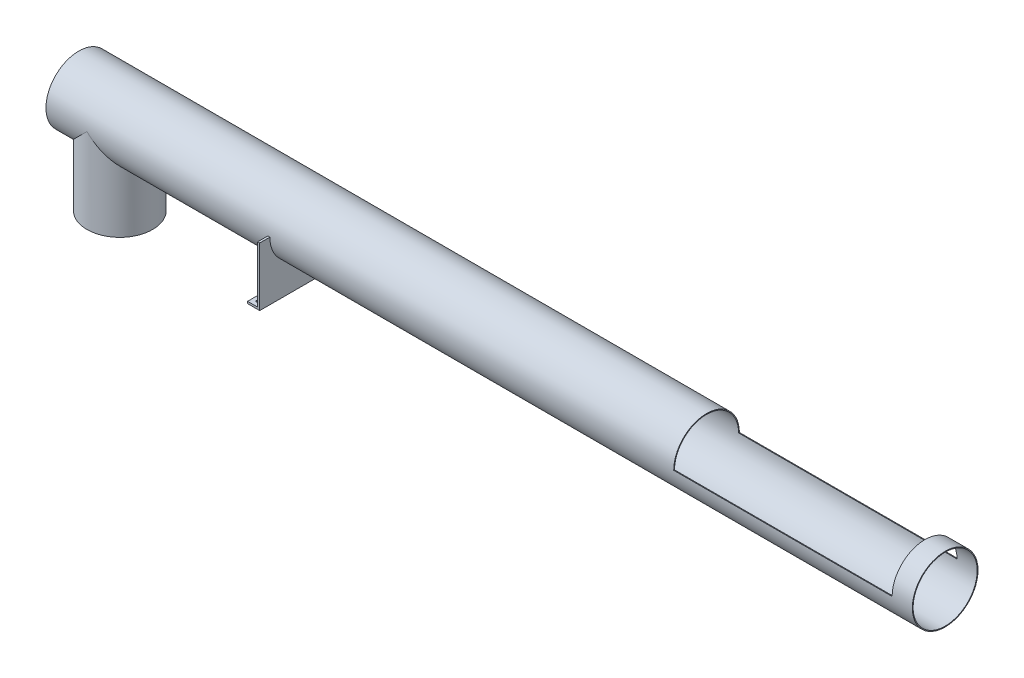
ISO-10303-21;
HEADER;
FILE_DESCRIPTION(('STEP AP214'),'2;1');
FILE_NAME('part.step','',(''),(''),'','','');
FILE_SCHEMA(('AUTOMOTIVE_DESIGN { 1 0 10303 214 1 1 1 1 }'));
ENDSEC;
DATA;
#1=APPLICATION_CONTEXT('core data for automotive mechanical design processes');
#2=APPLICATION_PROTOCOL_DEFINITION('international standard','automotive_design',2000,#1);
#3=PRODUCT_CONTEXT('',#1,'mechanical');
#4=PRODUCT('Part','Part','',(#3));
#5=PRODUCT_RELATED_PRODUCT_CATEGORY('part','',(#4));
#6=PRODUCT_DEFINITION_FORMATION('','',#4);
#7=PRODUCT_DEFINITION_CONTEXT('part definition',#1,'design');
#8=PRODUCT_DEFINITION('design','',#6,#7);
#9=PRODUCT_DEFINITION_SHAPE('','',#8);
#10=(LENGTH_UNIT() NAMED_UNIT(*) SI_UNIT(.MILLI.,.METRE.));
#11=(NAMED_UNIT(*) PLANE_ANGLE_UNIT() SI_UNIT($,.RADIAN.));
#12=(NAMED_UNIT(*) SI_UNIT($,.STERADIAN.) SOLID_ANGLE_UNIT());
#13=UNCERTAINTY_MEASURE_WITH_UNIT(LENGTH_MEASURE(1.E-05),#10,'distance_accuracy_value','');
#14=(GEOMETRIC_REPRESENTATION_CONTEXT(3) GLOBAL_UNCERTAINTY_ASSIGNED_CONTEXT((#13)) GLOBAL_UNIT_ASSIGNED_CONTEXT((#10,
#11,#12)) REPRESENTATION_CONTEXT('',''));
#15=CARTESIAN_POINT('',(0.,0.,0.));
#16=DIRECTION('',(0.,0.,1.));
#17=DIRECTION('',(1.,0.,0.));
#18=AXIS2_PLACEMENT_3D('',#15,#16,#17);
#19=CARTESIAN_POINT('',(0.,-280.,0.));
#20=DIRECTION('',(0.,1.,0.));
#21=DIRECTION('',(0.,0.,1.));
#22=AXIS2_PLACEMENT_3D('',#19,#20,#21);
#23=PLANE('',#22);
#24=DIRECTION('',(0.,0.,1.));
#25=VECTOR('',#24,1.);
#26=CARTESIAN_POINT('',(-1046.,-280.,212.5));
#27=LINE('',#26,#25);
#28=CARTESIAN_POINT('',(-1046.,-280.,-132.499999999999));
#29=VERTEX_POINT('',#28);
#30=CARTESIAN_POINT('',(-1046.,-280.,132.499999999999));
#31=VERTEX_POINT('',#30);
#32=EDGE_CURVE('E277',#29,#31,#27,.T.);
#33=ORIENTED_EDGE('',*,*,#32,.F.);
#34=DIRECTION('',(1.,0.,0.));
#35=VECTOR('',#34,1.);
#36=CARTESIAN_POINT('',(-1096.,-280.,-132.499999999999));
#37=LINE('',#36,#35);
#38=CARTESIAN_POINT('',(-1096.,-280.,-132.499999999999));
#39=VERTEX_POINT('',#38);
#40=EDGE_CURVE('E197',#39,#29,#37,.T.);
#41=ORIENTED_EDGE('',*,*,#40,.F.);
#42=DIRECTION('',(0.,0.,-1.));
#43=VECTOR('',#42,1.);
#44=CARTESIAN_POINT('',(-1096.,-280.,212.5));
#45=LINE('',#44,#43);
#46=CARTESIAN_POINT('',(-1096.,-280.,132.499999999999));
#47=VERTEX_POINT('',#46);
#48=EDGE_CURVE('E241',#47,#39,#45,.T.);
#49=ORIENTED_EDGE('',*,*,#48,.F.);
#50=DIRECTION('',(1.,0.,0.));
#51=VECTOR('',#50,1.);
#52=CARTESIAN_POINT('',(-1096.,-280.,132.499999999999));
#53=LINE('',#52,#51);
#54=EDGE_CURVE('E204',#47,#31,#53,.T.);
#55=ORIENTED_EDGE('',*,*,#54,.T.);
#56=EDGE_LOOP('',(#33,#41,#49,#55));
#57=FACE_BOUND('',#56,.T.);
#58=ADVANCED_FACE('F39',(#57),#23,.T.);
#59=CARTESIAN_POINT('',(-1071.,-280.,-187.5));
#60=DIRECTION('',(0.,-1.,0.));
#61=DIRECTION('',(0.,0.,-1.));
#62=AXIS2_PLACEMENT_3D('',#59,#60,#61);
#63=CIRCLE('',#62,6.4999999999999);
#64=CARTESIAN_POINT('',(-1071.,-280.,-194.));
#65=VERTEX_POINT('',#64);
#66=EDGE_CURVE('E433',#65,#65,#63,.T.);
#67=ORIENTED_EDGE('',*,*,#66,.T.);
#68=EDGE_LOOP('',(#67));
#69=FACE_BOUND('',#68,.T.);
#70=DIRECTION('',(1.,0.,0.));
#71=VECTOR('',#70,1.);
#72=CARTESIAN_POINT('',(-1096.,-280.,-142.499999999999));
#73=LINE('',#72,#71);
#74=CARTESIAN_POINT('',(-1096.,-280.,-142.499999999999));
#75=VERTEX_POINT('',#74);
#76=CARTESIAN_POINT('',(-1046.,-280.,-142.499999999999));
#77=VERTEX_POINT('',#76);
#78=EDGE_CURVE('E54',#75,#77,#73,.T.);
#79=ORIENTED_EDGE('',*,*,#78,.T.);
#80=CARTESIAN_POINT('',(-1046.,-280.,-212.5));
#81=VERTEX_POINT('',#80);
#82=EDGE_CURVE('E193',#81,#77,#27,.T.);
#83=ORIENTED_EDGE('',*,*,#82,.F.);
#84=DIRECTION('',(1.,0.,0.));
#85=VECTOR('',#84,1.);
#86=CARTESIAN_POINT('',(-1036.,-280.,-212.5));
#87=LINE('',#86,#85);
#88=CARTESIAN_POINT('',(-1096.,-280.,-212.5));
#89=VERTEX_POINT('',#88);
#90=EDGE_CURVE('E240',#89,#81,#87,.T.);
#91=ORIENTED_EDGE('',*,*,#90,.F.);
#92=EDGE_CURVE('E223',#75,#89,#45,.T.);
#93=ORIENTED_EDGE('',*,*,#92,.F.);
#94=EDGE_LOOP('',(#79,#83,#91,#93));
#95=FACE_BOUND('',#94,.T.);
#96=ADVANCED_FACE('F371',(#69,#95),#23,.T.);
#97=CARTESIAN_POINT('',(2144.,0.,0.));
#98=DIRECTION('',(-1.,0.,0.));
#99=DIRECTION('',(0.,0.,1.));
#100=AXIS2_PLACEMENT_3D('',#97,#98,#99);
#101=CYLINDRICAL_SURFACE('',#100,162.5);
#102=CARTESIAN_POINT('',(-1941.,0.,1.18851971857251E-13));
#103=DIRECTION('',(-0.707106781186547,-0.707106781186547,0.));
#104=DIRECTION('',(0.707106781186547,-0.707106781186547,0.));
#105=AXIS2_PLACEMENT_3D('',#102,#103,#104);
#106=ELLIPSE('',#105,229.809703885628,162.5);
#107=CARTESIAN_POINT('',(-1941.,0.,162.5));
#108=VERTEX_POINT('',#107);
#109=CARTESIAN_POINT('',(-1941.,0.,-162.5));
#110=VERTEX_POINT('',#109);
#111=EDGE_CURVE('E300',#108,#110,#106,.F.);
#112=ORIENTED_EDGE('',*,*,#111,.T.);
#113=CARTESIAN_POINT('',(-1941.,0.,1.18851971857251E-13));
#114=DIRECTION('',(0.707106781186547,-0.707106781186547,0.));
#115=DIRECTION('',(-0.707106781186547,-0.707106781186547,0.));
#116=AXIS2_PLACEMENT_3D('',#113,#114,#115);
#117=ELLIPSE('',#116,229.809703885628,162.5);
#118=EDGE_CURVE('E301',#110,#108,#117,.F.);
#119=ORIENTED_EDGE('',*,*,#118,.T.);
#120=EDGE_LOOP('',(#112,#119));
#121=FACE_BOUND('',#120,.T.);
#122=CARTESIAN_POINT('',(2144.,0.,0.));
#123=DIRECTION('',(1.,0.,0.));
#124=DIRECTION('',(0.,0.,-1.));
#125=AXIS2_PLACEMENT_3D('',#122,#123,#124);
#126=CIRCLE('',#125,162.5);
#127=CARTESIAN_POINT('',(2144.,0.,-162.5));
#128=VERTEX_POINT('',#127);
#129=EDGE_CURVE('E326',#128,#128,#126,.T.);
#130=ORIENTED_EDGE('',*,*,#129,.F.);
#131=EDGE_LOOP('',(#130));
#132=FACE_BOUND('',#131,.T.);
#133=CARTESIAN_POINT('',(-2144.,0.,0.));
#134=DIRECTION('',(1.,0.,0.));
#135=DIRECTION('',(0.,0.,-1.));
#136=AXIS2_PLACEMENT_3D('',#133,#134,#135);
#137=CIRCLE('',#136,162.5);
#138=CARTESIAN_POINT('',(-2144.,0.,-162.5));
#139=VERTEX_POINT('',#138);
#140=EDGE_CURVE('E323',#139,#139,#137,.T.);
#141=ORIENTED_EDGE('',*,*,#140,.T.);
#142=EDGE_LOOP('',(#141));
#143=FACE_BOUND('',#142,.T.);
#144=CARTESIAN_POINT('',(2044.,0.,0.));
#145=DIRECTION('',(-1.,0.,0.));
#146=DIRECTION('',(0.,0.,1.));
#147=AXIS2_PLACEMENT_3D('',#144,#145,#146);
#148=CIRCLE('',#147,162.5);
#149=CARTESIAN_POINT('',(2044.,0.,162.5));
#150=VERTEX_POINT('',#149);
#151=CARTESIAN_POINT('',(2044.,0.,-162.5));
#152=VERTEX_POINT('',#151);
#153=EDGE_CURVE('E317',#150,#152,#148,.T.);
#154=ORIENTED_EDGE('',*,*,#153,.F.);
#155=DIRECTION('',(1.,0.,0.));
#156=VECTOR('',#155,1.);
#157=CARTESIAN_POINT('',(2044.,0.,162.5));
#158=LINE('',#157,#156);
#159=CARTESIAN_POINT('',(963.,0.,162.5));
#160=VERTEX_POINT('',#159);
#161=EDGE_CURVE('E313',#160,#150,#158,.T.);
#162=ORIENTED_EDGE('',*,*,#161,.F.);
#163=CARTESIAN_POINT('',(963.,0.,0.));
#164=DIRECTION('',(1.,0.,0.));
#165=DIRECTION('',(0.,0.,-1.));
#166=AXIS2_PLACEMENT_3D('',#163,#164,#165);
#167=CIRCLE('',#166,162.5);
#168=CARTESIAN_POINT('',(963.,0.,-162.5));
#169=VERTEX_POINT('',#168);
#170=EDGE_CURVE('E315',#169,#160,#167,.T.);
#171=ORIENTED_EDGE('',*,*,#170,.F.);
#172=DIRECTION('',(-1.,0.,0.));
#173=VECTOR('',#172,1.);
#174=CARTESIAN_POINT('',(2044.,0.,-162.5));
#175=LINE('',#174,#173);
#176=EDGE_CURVE('E308',#152,#169,#175,.T.);
#177=ORIENTED_EDGE('',*,*,#176,.F.);
#178=EDGE_LOOP('',(#154,#162,#171,#177));
#179=FACE_BOUND('',#178,.T.);
#180=CARTESIAN_POINT('',(-1036.,0.,1.2490009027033E-13));
#181=DIRECTION('',(1.,0.,0.));
#182=DIRECTION('',(0.,0.,1.));
#183=AXIS2_PLACEMENT_3D('',#180,#181,#182);
#184=CIRCLE('',#183,162.5);
#185=CARTESIAN_POINT('',(-1036.,0.,162.5));
#186=VERTEX_POINT('',#185);
#187=CARTESIAN_POINT('',(-1036.,0.,-162.5));
#188=VERTEX_POINT('',#187);
#189=EDGE_CURVE('E251',#186,#188,#184,.T.);
#190=ORIENTED_EDGE('',*,*,#189,.T.);
#191=DIRECTION('',(-1.,0.,0.));
#192=VECTOR('',#191,1.);
#193=CARTESIAN_POINT('',(-1036.,0.,-162.5));
#194=LINE('',#193,#192);
#195=CARTESIAN_POINT('',(-1046.,0.,-162.5));
#196=VERTEX_POINT('',#195);
#197=EDGE_CURVE('E266',#188,#196,#194,.T.);
#198=ORIENTED_EDGE('',*,*,#197,.T.);
#199=CARTESIAN_POINT('',(-1046.,0.,1.2490009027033E-13));
#200=DIRECTION('',(1.,0.,0.));
#201=DIRECTION('',(0.,0.,1.));
#202=AXIS2_PLACEMENT_3D('',#199,#200,#201);
#203=CIRCLE('',#202,162.5);
#204=CARTESIAN_POINT('',(-1046.,0.,162.5));
#205=VERTEX_POINT('',#204);
#206=EDGE_CURVE('E250',#205,#196,#203,.T.);
#207=ORIENTED_EDGE('',*,*,#206,.F.);
#208=DIRECTION('',(-1.,0.,0.));
#209=VECTOR('',#208,1.);
#210=CARTESIAN_POINT('',(-1036.,0.,162.5));
#211=LINE('',#210,#209);
#212=EDGE_CURVE('E281',#186,#205,#211,.T.);
#213=ORIENTED_EDGE('',*,*,#212,.F.);
#214=EDGE_LOOP('',(#190,#198,#207,#213));
#215=FACE_BOUND('',#214,.T.);
#216=ADVANCED_FACE('F41',(#121,#132,#143,#179,#215),#101,.T.);
#217=CARTESIAN_POINT('',(2144.,0.,0.));
#218=DIRECTION('',(1.,0.,0.));
#219=DIRECTION('',(0.,0.,-1.));
#220=AXIS2_PLACEMENT_3D('',#217,#218,#219);
#221=PLANE('',#220);
#222=ORIENTED_EDGE('',*,*,#129,.T.);
#223=EDGE_LOOP('',(#222));
#224=FACE_BOUND('',#223,.T.);
#225=CARTESIAN_POINT('',(2144.,0.,0.));
#226=DIRECTION('',(1.,0.,0.));
#227=DIRECTION('',(0.,0.,-1.));
#228=AXIS2_PLACEMENT_3D('',#225,#226,#227);
#229=CIRCLE('',#228,158.5);
#230=CARTESIAN_POINT('',(2144.,0.,-158.5));
#231=VERTEX_POINT('',#230);
#232=EDGE_CURVE('E320',#231,#231,#229,.T.);
#233=ORIENTED_EDGE('',*,*,#232,.F.);
#234=EDGE_LOOP('',(#233));
#235=FACE_BOUND('',#234,.T.);
#236=ADVANCED_FACE('F615',(#224,#235),#221,.T.);
#237=CARTESIAN_POINT('',(-2144.,0.,0.));
#238=DIRECTION('',(1.,0.,0.));
#239=DIRECTION('',(0.,0.,-1.));
#240=AXIS2_PLACEMENT_3D('',#237,#238,#239);
#241=PLANE('',#240);
#242=ORIENTED_EDGE('',*,*,#140,.F.);
#243=EDGE_LOOP('',(#242));
#244=FACE_BOUND('',#243,.T.);
#245=CARTESIAN_POINT('',(-2144.,0.,0.));
#246=DIRECTION('',(1.,0.,0.));
#247=DIRECTION('',(0.,0.,-1.));
#248=AXIS2_PLACEMENT_3D('',#245,#246,#247);
#249=CIRCLE('',#248,158.5);
#250=CARTESIAN_POINT('',(-2144.,0.,-158.5));
#251=VERTEX_POINT('',#250);
#252=EDGE_CURVE('E319',#251,#251,#249,.T.);
#253=ORIENTED_EDGE('',*,*,#252,.T.);
#254=EDGE_LOOP('',(#253));
#255=FACE_BOUND('',#254,.T.);
#256=ADVANCED_FACE('F648',(#244,#255),#241,.F.);
#257=CARTESIAN_POINT('',(2144.,0.,0.));
#258=DIRECTION('',(-1.,0.,0.));
#259=DIRECTION('',(0.,0.,1.));
#260=AXIS2_PLACEMENT_3D('',#257,#258,#259);
#261=CYLINDRICAL_SURFACE('',#260,158.5);
#262=CARTESIAN_POINT('',(-1941.,0.,1.18851971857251E-13));
#263=DIRECTION('',(-0.707106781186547,-0.707106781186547,0.));
#264=DIRECTION('',(-0.707106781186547,0.707106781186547,0.));
#265=AXIS2_PLACEMENT_3D('',#262,#263,#264);
#266=ELLIPSE('',#265,224.152849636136,158.5);
#267=CARTESIAN_POINT('',(-1941.,0.,158.5));
#268=VERTEX_POINT('',#267);
#269=CARTESIAN_POINT('',(-1941.,0.,-158.5));
#270=VERTEX_POINT('',#269);
#271=EDGE_CURVE('E295',#268,#270,#266,.F.);
#272=ORIENTED_EDGE('',*,*,#271,.F.);
#273=CARTESIAN_POINT('',(-1941.,0.,1.18851971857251E-13));
#274=DIRECTION('',(-0.707106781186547,0.707106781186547,0.));
#275=DIRECTION('',(-0.707106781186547,-0.707106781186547,0.));
#276=AXIS2_PLACEMENT_3D('',#273,#274,#275);
#277=ELLIPSE('',#276,224.152849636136,158.5);
#278=EDGE_CURVE('E293',#270,#268,#277,.T.);
#279=ORIENTED_EDGE('',*,*,#278,.F.);
#280=EDGE_LOOP('',(#272,#279));
#281=FACE_BOUND('',#280,.T.);
#282=DIRECTION('',(-1.,0.,0.));
#283=VECTOR('',#282,1.);
#284=CARTESIAN_POINT('',(2144.,0.,158.5));
#285=LINE('',#284,#283);
#286=CARTESIAN_POINT('',(2044.,0.,158.5));
#287=VERTEX_POINT('',#286);
#288=CARTESIAN_POINT('',(963.,0.,158.5));
#289=VERTEX_POINT('',#288);
#290=EDGE_CURVE('E11',#287,#289,#285,.T.);
#291=ORIENTED_EDGE('',*,*,#290,.F.);
#292=CARTESIAN_POINT('',(2044.,0.,0.));
#293=DIRECTION('',(-1.,0.,0.));
#294=DIRECTION('',(0.,0.,1.));
#295=AXIS2_PLACEMENT_3D('',#292,#293,#294);
#296=CIRCLE('',#295,158.5);
#297=CARTESIAN_POINT('',(2044.,0.,-158.5));
#298=VERTEX_POINT('',#297);
#299=EDGE_CURVE('E47',#287,#298,#296,.T.);
#300=ORIENTED_EDGE('',*,*,#299,.T.);
#301=DIRECTION('',(-1.,0.,0.));
#302=VECTOR('',#301,1.);
#303=CARTESIAN_POINT('',(2144.,0.,-158.5));
#304=LINE('',#303,#302);
#305=CARTESIAN_POINT('',(963.,0.,-158.5));
#306=VERTEX_POINT('',#305);
#307=EDGE_CURVE('E329',#306,#298,#304,.F.);
#308=ORIENTED_EDGE('',*,*,#307,.F.);
#309=CARTESIAN_POINT('',(963.,0.,0.));
#310=DIRECTION('',(1.,0.,0.));
#311=DIRECTION('',(0.,0.,-1.));
#312=AXIS2_PLACEMENT_3D('',#309,#310,#311);
#313=CIRCLE('',#312,158.5);
#314=EDGE_CURVE('E333',#306,#289,#313,.T.);
#315=ORIENTED_EDGE('',*,*,#314,.T.);
#316=EDGE_LOOP('',(#291,#300,#308,#315));
#317=FACE_BOUND('',#316,.T.);
#318=ORIENTED_EDGE('',*,*,#232,.T.);
#319=EDGE_LOOP('',(#318));
#320=FACE_BOUND('',#319,.T.);
#321=ORIENTED_EDGE('',*,*,#252,.F.);
#322=EDGE_LOOP('',(#321));
#323=FACE_BOUND('',#322,.T.);
#324=ADVANCED_FACE('F339',(#281,#317,#320,#323),#261,.F.);
#325=CARTESIAN_POINT('',(2044.,162.5,-162.5));
#326=DIRECTION('',(-1.,0.,0.));
#327=DIRECTION('',(0.,0.,1.));
#328=AXIS2_PLACEMENT_3D('',#325,#326,#327);
#329=PLANE('',#328);
#330=ORIENTED_EDGE('',*,*,#153,.T.);
#331=DIRECTION('',(0.,0.,-1.));
#332=VECTOR('',#331,1.);
#333=CARTESIAN_POINT('',(2044.,0.,-162.5));
#334=LINE('',#333,#332);
#335=EDGE_CURVE('E303',#298,#152,#334,.T.);
#336=ORIENTED_EDGE('',*,*,#335,.F.);
#337=ORIENTED_EDGE('',*,*,#299,.F.);
#338=EDGE_CURVE('E305',#150,#287,#334,.T.);
#339=ORIENTED_EDGE('',*,*,#338,.F.);
#340=EDGE_LOOP('',(#330,#336,#337,#339));
#341=FACE_BOUND('',#340,.T.);
#342=ADVANCED_FACE('F344',(#341),#329,.T.);
#343=CARTESIAN_POINT('',(963.,162.5,-162.5));
#344=DIRECTION('',(1.,0.,0.));
#345=DIRECTION('',(0.,0.,-1.));
#346=AXIS2_PLACEMENT_3D('',#343,#344,#345);
#347=PLANE('',#346);
#348=ORIENTED_EDGE('',*,*,#170,.T.);
#349=DIRECTION('',(0.,0.,1.));
#350=VECTOR('',#349,1.);
#351=CARTESIAN_POINT('',(963.,0.,-162.5));
#352=LINE('',#351,#350);
#353=EDGE_CURVE('E310',#289,#160,#352,.T.);
#354=ORIENTED_EDGE('',*,*,#353,.F.);
#355=ORIENTED_EDGE('',*,*,#314,.F.);
#356=EDGE_CURVE('E311',#169,#306,#352,.T.);
#357=ORIENTED_EDGE('',*,*,#356,.F.);
#358=EDGE_LOOP('',(#348,#354,#355,#357));
#359=FACE_BOUND('',#358,.T.);
#360=ADVANCED_FACE('F361',(#359),#347,.T.);
#361=CARTESIAN_POINT('',(0.,0.,0.));
#362=DIRECTION('',(0.,-1.,0.));
#363=DIRECTION('',(0.,0.,-1.));
#364=AXIS2_PLACEMENT_3D('',#361,#362,#363);
#365=PLANE('',#364);
#366=ORIENTED_EDGE('',*,*,#290,.T.);
#367=ORIENTED_EDGE('',*,*,#353,.T.);
#368=ORIENTED_EDGE('',*,*,#161,.T.);
#369=ORIENTED_EDGE('',*,*,#338,.T.);
#370=EDGE_LOOP('',(#366,#367,#368,#369));
#371=FACE_BOUND('',#370,.T.);
#372=ADVANCED_FACE('F348',(#371),#365,.F.);
#373=ORIENTED_EDGE('',*,*,#307,.T.);
#374=ORIENTED_EDGE('',*,*,#335,.T.);
#375=ORIENTED_EDGE('',*,*,#176,.T.);
#376=ORIENTED_EDGE('',*,*,#356,.T.);
#377=EDGE_LOOP('',(#373,#374,#375,#376));
#378=FACE_BOUND('',#377,.T.);
#379=ADVANCED_FACE('F357',(#378),#365,.F.);
#380=CARTESIAN_POINT('',(-1941.,-420.,2.37703943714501E-13));
#381=DIRECTION('',(0.,1.,0.));
#382=DIRECTION('',(0.,0.,1.));
#383=AXIS2_PLACEMENT_3D('',#380,#381,#382);
#384=PLANE('',#383);
#385=CARTESIAN_POINT('',(-1941.,-420.,2.37703943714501E-13));
#386=DIRECTION('',(0.,-1.,0.));
#387=DIRECTION('',(0.,0.,-1.));
#388=AXIS2_PLACEMENT_3D('',#385,#386,#387);
#389=CIRCLE('',#388,158.5);
#390=CARTESIAN_POINT('',(-1941.,-420.,-158.5));
#391=VERTEX_POINT('',#390);
#392=EDGE_CURVE('E284',#391,#391,#389,.T.);
#393=ORIENTED_EDGE('',*,*,#392,.F.);
#394=EDGE_LOOP('',(#393));
#395=FACE_BOUND('',#394,.T.);
#396=CARTESIAN_POINT('',(-1941.,-420.,2.37703943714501E-13));
#397=DIRECTION('',(0.,1.,0.));
#398=DIRECTION('',(0.,0.,1.));
#399=AXIS2_PLACEMENT_3D('',#396,#397,#398);
#400=CIRCLE('',#399,162.5);
#401=CARTESIAN_POINT('',(-1941.,-420.,162.5));
#402=VERTEX_POINT('',#401);
#403=EDGE_CURVE('E297',#402,#402,#400,.T.);
#404=ORIENTED_EDGE('',*,*,#403,.F.);
#405=EDGE_LOOP('',(#404));
#406=FACE_BOUND('',#405,.T.);
#407=ADVANCED_FACE('F632',(#395,#406),#384,.F.);
#408=CARTESIAN_POINT('',(-1941.,500000.,2.37703943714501E-13));
#409=DIRECTION('',(0.,-1.,0.));
#410=DIRECTION('',(0.,0.,-1.));
#411=AXIS2_PLACEMENT_3D('',#408,#409,#410);
#412=CYLINDRICAL_SURFACE('',#411,162.5);
#413=ORIENTED_EDGE('',*,*,#403,.T.);
#414=EDGE_LOOP('',(#413));
#415=FACE_BOUND('',#414,.T.);
#416=ORIENTED_EDGE('',*,*,#111,.F.);
#417=ORIENTED_EDGE('',*,*,#118,.F.);
#418=EDGE_LOOP('',(#416,#417));
#419=FACE_BOUND('',#418,.T.);
#420=ADVANCED_FACE('F624',(#415,#419),#412,.T.);
#421=CARTESIAN_POINT('',(-1941.,448.305699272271,2.37703943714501E-13));
#422=DIRECTION('',(0.,-1.,0.));
#423=DIRECTION('',(0.,0.,-1.));
#424=AXIS2_PLACEMENT_3D('',#421,#422,#423);
#425=CYLINDRICAL_SURFACE('',#424,158.5);
#426=ORIENTED_EDGE('',*,*,#271,.T.);
#427=ORIENTED_EDGE('',*,*,#278,.T.);
#428=EDGE_LOOP('',(#426,#427));
#429=FACE_BOUND('',#428,.T.);
#430=ORIENTED_EDGE('',*,*,#392,.T.);
#431=EDGE_LOOP('',(#430));
#432=FACE_BOUND('',#431,.T.);
#433=ADVANCED_FACE('F606',(#429,#432),#425,.F.);
#434=CARTESIAN_POINT('',(-1036.,0.,162.5));
#435=DIRECTION('',(0.,1.,0.));
#436=DIRECTION('',(0.,0.,1.));
#437=AXIS2_PLACEMENT_3D('',#434,#435,#436);
#438=PLANE('',#437);
#439=DIRECTION('',(0.,0.,-1.));
#440=VECTOR('',#439,1.);
#441=CARTESIAN_POINT('',(-1046.,0.,162.5));
#442=LINE('',#441,#440);
#443=CARTESIAN_POINT('',(-1046.,0.,212.5));
#444=VERTEX_POINT('',#443);
#445=EDGE_CURVE('E255',#444,#205,#442,.T.);
#446=ORIENTED_EDGE('',*,*,#445,.F.);
#447=DIRECTION('',(-1.,0.,0.));
#448=VECTOR('',#447,1.);
#449=CARTESIAN_POINT('',(-1036.,0.,212.5));
#450=LINE('',#449,#448);
#451=CARTESIAN_POINT('',(-1036.,0.,212.5));
#452=VERTEX_POINT('',#451);
#453=EDGE_CURVE('E285',#452,#444,#450,.T.);
#454=ORIENTED_EDGE('',*,*,#453,.F.);
#455=DIRECTION('',(0.,0.,-1.));
#456=VECTOR('',#455,1.);
#457=CARTESIAN_POINT('',(-1036.,0.,162.5));
#458=LINE('',#457,#456);
#459=EDGE_CURVE('E263',#452,#186,#458,.T.);
#460=ORIENTED_EDGE('',*,*,#459,.T.);
#461=ORIENTED_EDGE('',*,*,#212,.T.);
#462=EDGE_LOOP('',(#446,#454,#460,#461));
#463=FACE_BOUND('',#462,.T.);
#464=ADVANCED_FACE('F414',(#463),#438,.T.);
#465=CARTESIAN_POINT('',(-1036.,-280.,212.5));
#466=DIRECTION('',(0.,0.,1.));
#467=DIRECTION('',(1.,0.,0.));
#468=AXIS2_PLACEMENT_3D('',#465,#466,#467);
#469=PLANE('',#468);
#470=DIRECTION('',(0.,1.,0.));
#471=VECTOR('',#470,1.);
#472=CARTESIAN_POINT('',(-1046.,-280.,212.5));
#473=LINE('',#472,#471);
#474=CARTESIAN_POINT('',(-1046.,-280.,212.5));
#475=VERTEX_POINT('',#474);
#476=EDGE_CURVE('E276',#475,#444,#473,.T.);
#477=ORIENTED_EDGE('',*,*,#476,.F.);
#478=DIRECTION('',(-1.,0.,0.));
#479=VECTOR('',#478,1.);
#480=CARTESIAN_POINT('',(-1036.,-280.,212.5));
#481=LINE('',#480,#479);
#482=CARTESIAN_POINT('',(-1096.,-280.,212.5));
#483=VERTEX_POINT('',#482);
#484=EDGE_CURVE('E228',#475,#483,#481,.T.);
#485=ORIENTED_EDGE('',*,*,#484,.T.);
#486=DIRECTION('',(0.,1.,0.));
#487=VECTOR('',#486,1.);
#488=CARTESIAN_POINT('',(-1096.,-290.,212.5));
#489=LINE('',#488,#487);
#490=CARTESIAN_POINT('',(-1096.,-290.,212.5));
#491=VERTEX_POINT('',#490);
#492=EDGE_CURVE('E236',#491,#483,#489,.T.);
#493=ORIENTED_EDGE('',*,*,#492,.F.);
#494=DIRECTION('',(-1.,0.,0.));
#495=VECTOR('',#494,1.);
#496=CARTESIAN_POINT('',(-1036.,-290.,212.5));
#497=LINE('',#496,#495);
#498=CARTESIAN_POINT('',(-1036.,-290.,212.5));
#499=VERTEX_POINT('',#498);
#500=EDGE_CURVE('E234',#499,#491,#497,.T.);
#501=ORIENTED_EDGE('',*,*,#500,.F.);
#502=DIRECTION('',(0.,1.,0.));
#503=VECTOR('',#502,1.);
#504=CARTESIAN_POINT('',(-1036.,-280.,212.5));
#505=LINE('',#504,#503);
#506=EDGE_CURVE('E260',#499,#452,#505,.T.);
#507=ORIENTED_EDGE('',*,*,#506,.T.);
#508=ORIENTED_EDGE('',*,*,#453,.T.);
#509=EDGE_LOOP('',(#477,#485,#493,#501,#507,#508));
#510=FACE_BOUND('',#509,.T.);
#511=ADVANCED_FACE('F411',(#510),#469,.T.);
#512=CARTESIAN_POINT('',(-1036.,-280.,-212.5));
#513=DIRECTION('',(0.,0.,-1.));
#514=DIRECTION('',(-1.,0.,0.));
#515=AXIS2_PLACEMENT_3D('',#512,#513,#514);
#516=PLANE('',#515);
#517=DIRECTION('',(0.,-1.,0.));
#518=VECTOR('',#517,1.);
#519=CARTESIAN_POINT('',(-1046.,-280.,-212.5));
#520=LINE('',#519,#518);
#521=CARTESIAN_POINT('',(-1046.,0.,-212.5));
#522=VERTEX_POINT('',#521);
#523=EDGE_CURVE('E272',#522,#81,#520,.T.);
#524=ORIENTED_EDGE('',*,*,#523,.F.);
#525=DIRECTION('',(-1.,0.,0.));
#526=VECTOR('',#525,1.);
#527=CARTESIAN_POINT('',(-1036.,0.,-212.5));
#528=LINE('',#527,#526);
#529=CARTESIAN_POINT('',(-1036.,0.,-212.5));
#530=VERTEX_POINT('',#529);
#531=EDGE_CURVE('E287',#530,#522,#528,.T.);
#532=ORIENTED_EDGE('',*,*,#531,.F.);
#533=DIRECTION('',(0.,-1.,0.));
#534=VECTOR('',#533,1.);
#535=CARTESIAN_POINT('',(-1036.,-280.,-212.5));
#536=LINE('',#535,#534);
#537=CARTESIAN_POINT('',(-1036.,-290.,-212.5));
#538=VERTEX_POINT('',#537);
#539=EDGE_CURVE('E258',#530,#538,#536,.T.);
#540=ORIENTED_EDGE('',*,*,#539,.T.);
#541=DIRECTION('',(1.,0.,0.));
#542=VECTOR('',#541,1.);
#543=CARTESIAN_POINT('',(-1036.,-290.,-212.5));
#544=LINE('',#543,#542);
#545=CARTESIAN_POINT('',(-1096.,-290.,-212.5));
#546=VERTEX_POINT('',#545);
#547=EDGE_CURVE('E227',#546,#538,#544,.T.);
#548=ORIENTED_EDGE('',*,*,#547,.F.);
#549=DIRECTION('',(0.,1.,0.));
#550=VECTOR('',#549,1.);
#551=CARTESIAN_POINT('',(-1096.,-290.,-212.5));
#552=LINE('',#551,#550);
#553=EDGE_CURVE('E247',#546,#89,#552,.T.);
#554=ORIENTED_EDGE('',*,*,#553,.T.);
#555=ORIENTED_EDGE('',*,*,#90,.T.);
#556=EDGE_LOOP('',(#524,#532,#540,#548,#554,#555));
#557=FACE_BOUND('',#556,.T.);
#558=ADVANCED_FACE('F424',(#557),#516,.T.);
#559=CARTESIAN_POINT('',(-1036.,0.,-162.5));
#560=DIRECTION('',(0.,1.,0.));
#561=DIRECTION('',(0.,0.,1.));
#562=AXIS2_PLACEMENT_3D('',#559,#560,#561);
#563=PLANE('',#562);
#564=DIRECTION('',(0.,0.,-1.));
#565=VECTOR('',#564,1.);
#566=CARTESIAN_POINT('',(-1046.,0.,-162.5));
#567=LINE('',#566,#565);
#568=EDGE_CURVE('E269',#196,#522,#567,.T.);
#569=ORIENTED_EDGE('',*,*,#568,.F.);
#570=ORIENTED_EDGE('',*,*,#197,.F.);
#571=DIRECTION('',(0.,0.,-1.));
#572=VECTOR('',#571,1.);
#573=CARTESIAN_POINT('',(-1036.,0.,-162.5));
#574=LINE('',#573,#572);
#575=EDGE_CURVE('E254',#188,#530,#574,.T.);
#576=ORIENTED_EDGE('',*,*,#575,.T.);
#577=ORIENTED_EDGE('',*,*,#531,.T.);
#578=EDGE_LOOP('',(#569,#570,#576,#577));
#579=FACE_BOUND('',#578,.T.);
#580=ADVANCED_FACE('F420',(#579),#563,.T.);
#581=CARTESIAN_POINT('',(-1036.,0.,1.2490009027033E-13));
#582=DIRECTION('',(-1.,0.,0.));
#583=DIRECTION('',(0.,0.,1.));
#584=AXIS2_PLACEMENT_3D('',#581,#582,#583);
#585=PLANE('',#584);
#586=ORIENTED_EDGE('',*,*,#189,.F.);
#587=ORIENTED_EDGE('',*,*,#459,.F.);
#588=ORIENTED_EDGE('',*,*,#506,.F.);
#589=DIRECTION('',(0.,0.,1.));
#590=VECTOR('',#589,1.);
#591=CARTESIAN_POINT('',(-1036.,-290.,212.5));
#592=LINE('',#591,#590);
#593=EDGE_CURVE('E231',#538,#499,#592,.T.);
#594=ORIENTED_EDGE('',*,*,#593,.F.);
#595=ORIENTED_EDGE('',*,*,#539,.F.);
#596=ORIENTED_EDGE('',*,*,#575,.F.);
#597=EDGE_LOOP('',(#586,#587,#588,#594,#595,#596));
#598=FACE_BOUND('',#597,.T.);
#599=ADVANCED_FACE('F391',(#598),#585,.F.);
#600=CARTESIAN_POINT('',(-1046.,0.,1.2490009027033E-13));
#601=DIRECTION('',(-1.,0.,0.));
#602=DIRECTION('',(0.,0.,1.));
#603=AXIS2_PLACEMENT_3D('',#600,#601,#602);
#604=PLANE('',#603);
#605=DIRECTION('',(0.,1.,0.));
#606=VECTOR('',#605,1.);
#607=CARTESIAN_POINT('',(-1046.,-280.,-142.499999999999));
#608=LINE('',#607,#606);
#609=CARTESIAN_POINT('',(-1046.,-200.,-142.499999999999));
#610=VERTEX_POINT('',#609);
#611=EDGE_CURVE('E176',#77,#610,#608,.T.);
#612=ORIENTED_EDGE('',*,*,#611,.T.);
#613=DIRECTION('',(0.,0.,1.));
#614=VECTOR('',#613,1.);
#615=CARTESIAN_POINT('',(-1046.,-200.,-142.499999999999));
#616=LINE('',#615,#614);
#617=CARTESIAN_POINT('',(-1046.,-200.,-132.499999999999));
#618=VERTEX_POINT('',#617);
#619=EDGE_CURVE('E181',#610,#618,#616,.T.);
#620=ORIENTED_EDGE('',*,*,#619,.T.);
#621=DIRECTION('',(0.,1.,0.));
#622=VECTOR('',#621,1.);
#623=CARTESIAN_POINT('',(-1046.,-280.,-132.499999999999));
#624=LINE('',#623,#622);
#625=EDGE_CURVE('E201',#29,#618,#624,.T.);
#626=ORIENTED_EDGE('',*,*,#625,.F.);
#627=ORIENTED_EDGE('',*,*,#32,.T.);
#628=DIRECTION('',(0.,1.,0.));
#629=VECTOR('',#628,1.);
#630=CARTESIAN_POINT('',(-1046.,-280.,132.499999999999));
#631=LINE('',#630,#629);
#632=CARTESIAN_POINT('',(-1046.,-200.,132.499999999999));
#633=VERTEX_POINT('',#632);
#634=EDGE_CURVE('E215',#31,#633,#631,.T.);
#635=ORIENTED_EDGE('',*,*,#634,.T.);
#636=DIRECTION('',(0.,0.,-1.));
#637=VECTOR('',#636,1.);
#638=CARTESIAN_POINT('',(-1046.,-200.,142.499999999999));
#639=LINE('',#638,#637);
#640=CARTESIAN_POINT('',(-1046.,-200.,142.499999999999));
#641=VERTEX_POINT('',#640);
#642=EDGE_CURVE('E221',#641,#633,#639,.T.);
#643=ORIENTED_EDGE('',*,*,#642,.F.);
#644=DIRECTION('',(0.,1.,0.));
#645=VECTOR('',#644,1.);
#646=CARTESIAN_POINT('',(-1046.,-280.,142.499999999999));
#647=LINE('',#646,#645);
#648=CARTESIAN_POINT('',(-1046.,-280.,142.499999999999));
#649=VERTEX_POINT('',#648);
#650=EDGE_CURVE('E207',#649,#641,#647,.T.);
#651=ORIENTED_EDGE('',*,*,#650,.F.);
#652=EDGE_CURVE('E274',#649,#475,#27,.T.);
#653=ORIENTED_EDGE('',*,*,#652,.T.);
#654=ORIENTED_EDGE('',*,*,#476,.T.);
#655=ORIENTED_EDGE('',*,*,#445,.T.);
#656=ORIENTED_EDGE('',*,*,#206,.T.);
#657=ORIENTED_EDGE('',*,*,#568,.T.);
#658=ORIENTED_EDGE('',*,*,#523,.T.);
#659=ORIENTED_EDGE('',*,*,#82,.T.);
#660=EDGE_LOOP('',(#612,#620,#626,#627,#635,#643,#651,#653,#654,#655,#656,#657,#658,#659));
#661=FACE_BOUND('',#660,.T.);
#662=ADVANCED_FACE('F191',(#661),#604,.T.);
#663=CARTESIAN_POINT('',(-1071.,-280.,187.5));
#664=DIRECTION('',(0.,1.,0.));
#665=DIRECTION('',(0.,0.,1.));
#666=AXIS2_PLACEMENT_3D('',#663,#664,#665);
#667=CIRCLE('',#666,6.4999999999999);
#668=CARTESIAN_POINT('',(-1071.,-280.,194.));
#669=VERTEX_POINT('',#668);
#670=EDGE_CURVE('E396',#669,#669,#667,.T.);
#671=ORIENTED_EDGE('',*,*,#670,.F.);
#672=EDGE_LOOP('',(#671));
#673=FACE_BOUND('',#672,.T.);
#674=DIRECTION('',(1.,0.,0.));
#675=VECTOR('',#674,1.);
#676=CARTESIAN_POINT('',(-1096.,-280.,142.499999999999));
#677=LINE('',#676,#675);
#678=CARTESIAN_POINT('',(-1096.,-280.,142.499999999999));
#679=VERTEX_POINT('',#678);
#680=EDGE_CURVE('E205',#679,#649,#677,.T.);
#681=ORIENTED_EDGE('',*,*,#680,.F.);
#682=EDGE_CURVE('E237',#483,#679,#45,.T.);
#683=ORIENTED_EDGE('',*,*,#682,.F.);
#684=ORIENTED_EDGE('',*,*,#484,.F.);
#685=ORIENTED_EDGE('',*,*,#652,.F.);
#686=EDGE_LOOP('',(#681,#683,#684,#685));
#687=FACE_BOUND('',#686,.T.);
#688=ADVANCED_FACE('F374',(#673,#687),#23,.T.);
#689=CARTESIAN_POINT('',(-1096.,-290.,212.5));
#690=DIRECTION('',(1.,0.,0.));
#691=DIRECTION('',(0.,0.,-1.));
#692=AXIS2_PLACEMENT_3D('',#689,#690,#691);
#693=PLANE('',#692);
#694=ORIENTED_EDGE('',*,*,#682,.T.);
#695=DIRECTION('',(0.,0.,-1.));
#696=VECTOR('',#695,1.);
#697=CARTESIAN_POINT('',(-1096.,-280.,142.499999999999));
#698=LINE('',#697,#696);
#699=EDGE_CURVE('E212',#679,#47,#698,.T.);
#700=ORIENTED_EDGE('',*,*,#699,.T.);
#701=ORIENTED_EDGE('',*,*,#48,.T.);
#702=DIRECTION('',(0.,0.,1.));
#703=VECTOR('',#702,1.);
#704=CARTESIAN_POINT('',(-1096.,-280.,-142.499999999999));
#705=LINE('',#704,#703);
#706=EDGE_CURVE('E188',#75,#39,#705,.T.);
#707=ORIENTED_EDGE('',*,*,#706,.F.);
#708=ORIENTED_EDGE('',*,*,#92,.T.);
#709=ORIENTED_EDGE('',*,*,#553,.F.);
#710=DIRECTION('',(0.,0.,-1.));
#711=VECTOR('',#710,1.);
#712=CARTESIAN_POINT('',(-1096.,-290.,212.5));
#713=LINE('',#712,#711);
#714=EDGE_CURVE('E224',#491,#546,#713,.T.);
#715=ORIENTED_EDGE('',*,*,#714,.F.);
#716=ORIENTED_EDGE('',*,*,#492,.T.);
#717=EDGE_LOOP('',(#694,#700,#701,#707,#708,#709,#715,#716));
#718=FACE_BOUND('',#717,.T.);
#719=ADVANCED_FACE('F383',(#718),#693,.F.);
#720=CARTESIAN_POINT('',(0.,-290.,0.));
#721=DIRECTION('',(0.,1.,0.));
#722=DIRECTION('',(0.,0.,1.));
#723=AXIS2_PLACEMENT_3D('',#720,#721,#722);
#724=PLANE('',#723);
#725=CARTESIAN_POINT('',(-1071.,-290.,-187.5));
#726=DIRECTION('',(0.,-1.,0.));
#727=DIRECTION('',(0.,0.,-1.));
#728=AXIS2_PLACEMENT_3D('',#725,#726,#727);
#729=CIRCLE('',#728,6.4999999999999);
#730=CARTESIAN_POINT('',(-1071.,-290.,-194.));
#731=VERTEX_POINT('',#730);
#732=EDGE_CURVE('E430',#731,#731,#729,.T.);
#733=ORIENTED_EDGE('',*,*,#732,.F.);
#734=EDGE_LOOP('',(#733));
#735=FACE_BOUND('',#734,.T.);
#736=CARTESIAN_POINT('',(-1071.,-290.,187.5));
#737=DIRECTION('',(0.,1.,0.));
#738=DIRECTION('',(0.,0.,1.));
#739=AXIS2_PLACEMENT_3D('',#736,#737,#738);
#740=CIRCLE('',#739,6.4999999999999);
#741=CARTESIAN_POINT('',(-1071.,-290.,194.));
#742=VERTEX_POINT('',#741);
#743=EDGE_CURVE('E199',#742,#742,#740,.T.);
#744=ORIENTED_EDGE('',*,*,#743,.T.);
#745=EDGE_LOOP('',(#744));
#746=FACE_BOUND('',#745,.T.);
#747=ORIENTED_EDGE('',*,*,#714,.T.);
#748=ORIENTED_EDGE('',*,*,#547,.T.);
#749=ORIENTED_EDGE('',*,*,#593,.T.);
#750=ORIENTED_EDGE('',*,*,#500,.T.);
#751=EDGE_LOOP('',(#747,#748,#749,#750));
#752=FACE_BOUND('',#751,.T.);
#753=ADVANCED_FACE('F389',(#735,#746,#752),#724,.F.);
#754=CARTESIAN_POINT('',(-1096.,-280.,142.499999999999));
#755=DIRECTION('',(-0.847998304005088,0.52999894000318,0.));
#756=DIRECTION('',(-0.52999894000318,-0.847998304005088,0.));
#757=AXIS2_PLACEMENT_3D('',#754,#755,#756);
#758=PLANE('',#757);
#759=DIRECTION('',(0.52999894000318,0.847998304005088,0.));
#760=VECTOR('',#759,1.);
#761=CARTESIAN_POINT('',(-1096.,-280.,132.499999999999));
#762=LINE('',#761,#760);
#763=EDGE_CURVE('E62',#47,#633,#762,.T.);
#764=ORIENTED_EDGE('',*,*,#763,.F.);
#765=ORIENTED_EDGE('',*,*,#699,.F.);
#766=DIRECTION('',(0.52999894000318,0.847998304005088,0.));
#767=VECTOR('',#766,1.);
#768=CARTESIAN_POINT('',(-1096.,-280.,142.499999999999));
#769=LINE('',#768,#767);
#770=EDGE_CURVE('E209',#679,#641,#769,.T.);
#771=ORIENTED_EDGE('',*,*,#770,.T.);
#772=ORIENTED_EDGE('',*,*,#642,.T.);
#773=EDGE_LOOP('',(#764,#765,#771,#772));
#774=FACE_BOUND('',#773,.T.);
#775=ADVANCED_FACE('F444',(#774),#758,.T.);
#776=CARTESIAN_POINT('',(0.,0.,142.499999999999));
#777=DIRECTION('',(0.,0.,1.));
#778=DIRECTION('',(1.,0.,0.));
#779=AXIS2_PLACEMENT_3D('',#776,#777,#778);
#780=PLANE('',#779);
#781=ORIENTED_EDGE('',*,*,#680,.T.);
#782=ORIENTED_EDGE('',*,*,#650,.T.);
#783=ORIENTED_EDGE('',*,*,#770,.F.);
#784=EDGE_LOOP('',(#781,#782,#783));
#785=FACE_BOUND('',#784,.T.);
#786=ADVANCED_FACE('F457',(#785),#780,.T.);
#787=CARTESIAN_POINT('',(0.,0.,132.499999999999));
#788=DIRECTION('',(0.,0.,1.));
#789=DIRECTION('',(1.,0.,0.));
#790=AXIS2_PLACEMENT_3D('',#787,#788,#789);
#791=PLANE('',#790);
#792=ORIENTED_EDGE('',*,*,#54,.F.);
#793=ORIENTED_EDGE('',*,*,#763,.T.);
#794=ORIENTED_EDGE('',*,*,#634,.F.);
#795=EDGE_LOOP('',(#792,#793,#794));
#796=FACE_BOUND('',#795,.T.);
#797=ADVANCED_FACE('F455',(#796),#791,.F.);
#798=CARTESIAN_POINT('',(-1096.,-280.,-142.499999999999));
#799=DIRECTION('',(0.847998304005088,-0.52999894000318,0.));
#800=DIRECTION('',(0.52999894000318,0.847998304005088,0.));
#801=AXIS2_PLACEMENT_3D('',#798,#799,#800);
#802=PLANE('',#801);
#803=DIRECTION('',(0.52999894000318,0.847998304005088,0.));
#804=VECTOR('',#803,1.);
#805=CARTESIAN_POINT('',(-1096.,-280.,-132.499999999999));
#806=LINE('',#805,#804);
#807=EDGE_CURVE('E184',#39,#618,#806,.T.);
#808=ORIENTED_EDGE('',*,*,#807,.T.);
#809=ORIENTED_EDGE('',*,*,#619,.F.);
#810=DIRECTION('',(0.52999894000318,0.847998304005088,0.));
#811=VECTOR('',#810,1.);
#812=CARTESIAN_POINT('',(-1096.,-280.,-142.499999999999));
#813=LINE('',#812,#811);
#814=EDGE_CURVE('E172',#75,#610,#813,.T.);
#815=ORIENTED_EDGE('',*,*,#814,.F.);
#816=ORIENTED_EDGE('',*,*,#706,.T.);
#817=EDGE_LOOP('',(#808,#809,#815,#816));
#818=FACE_BOUND('',#817,.T.);
#819=ADVANCED_FACE('F182',(#818),#802,.F.);
#820=CARTESIAN_POINT('',(0.,0.,-142.499999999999));
#821=DIRECTION('',(0.,0.,-1.));
#822=DIRECTION('',(1.,0.,0.));
#823=AXIS2_PLACEMENT_3D('',#820,#821,#822);
#824=PLANE('',#823);
#825=ORIENTED_EDGE('',*,*,#78,.F.);
#826=ORIENTED_EDGE('',*,*,#814,.T.);
#827=ORIENTED_EDGE('',*,*,#611,.F.);
#828=EDGE_LOOP('',(#825,#826,#827));
#829=FACE_BOUND('',#828,.T.);
#830=ADVANCED_FACE('F174',(#829),#824,.T.);
#831=CARTESIAN_POINT('',(0.,0.,-132.499999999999));
#832=DIRECTION('',(0.,0.,-1.));
#833=DIRECTION('',(1.,0.,0.));
#834=AXIS2_PLACEMENT_3D('',#831,#832,#833);
#835=PLANE('',#834);
#836=ORIENTED_EDGE('',*,*,#40,.T.);
#837=ORIENTED_EDGE('',*,*,#625,.T.);
#838=ORIENTED_EDGE('',*,*,#807,.F.);
#839=EDGE_LOOP('',(#836,#837,#838));
#840=FACE_BOUND('',#839,.T.);
#841=ADVANCED_FACE('F451',(#840),#835,.F.);
#842=CARTESIAN_POINT('',(-1071.,-290.,187.5));
#843=DIRECTION('',(0.,1.,0.));
#844=DIRECTION('',(0.,0.,1.));
#845=AXIS2_PLACEMENT_3D('',#842,#843,#844);
#846=CYLINDRICAL_SURFACE('',#845,6.4999999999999);
#847=ORIENTED_EDGE('',*,*,#743,.F.);
#848=EDGE_LOOP('',(#847));
#849=FACE_BOUND('',#848,.T.);
#850=ORIENTED_EDGE('',*,*,#670,.T.);
#851=EDGE_LOOP('',(#850));
#852=FACE_BOUND('',#851,.T.);
#853=ADVANCED_FACE('F523',(#849,#852),#846,.F.);
#854=CARTESIAN_POINT('',(-1071.,-290.,-187.5));
#855=DIRECTION('',(0.,1.,0.));
#856=DIRECTION('',(0.,0.,1.));
#857=AXIS2_PLACEMENT_3D('',#854,#855,#856);
#858=CYLINDRICAL_SURFACE('',#857,6.4999999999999);
#859=ORIENTED_EDGE('',*,*,#732,.T.);
#860=EDGE_LOOP('',(#859));
#861=FACE_BOUND('',#860,.T.);
#862=ORIENTED_EDGE('',*,*,#66,.F.);
#863=EDGE_LOOP('',(#862));
#864=FACE_BOUND('',#863,.T.);
#865=ADVANCED_FACE('F439',(#861,#864),#858,.F.);
#866=CLOSED_SHELL('',(#58,#96,#216,#236,#256,#324,#342,#360,#372,#379,#407,#420,#433,#464,#511,
#558,#580,#599,#662,#688,#719,#753,#775,#786,#797,#819,#830,#841,#853,#865));
#867=MANIFOLD_SOLID_BREP('B2',#866);
#868=ADVANCED_BREP_SHAPE_REPRESENTATION('',(#18,#867),#14);
#869=SHAPE_DEFINITION_REPRESENTATION(#9,#868);
ENDSEC;
END-ISO-10303-21;
